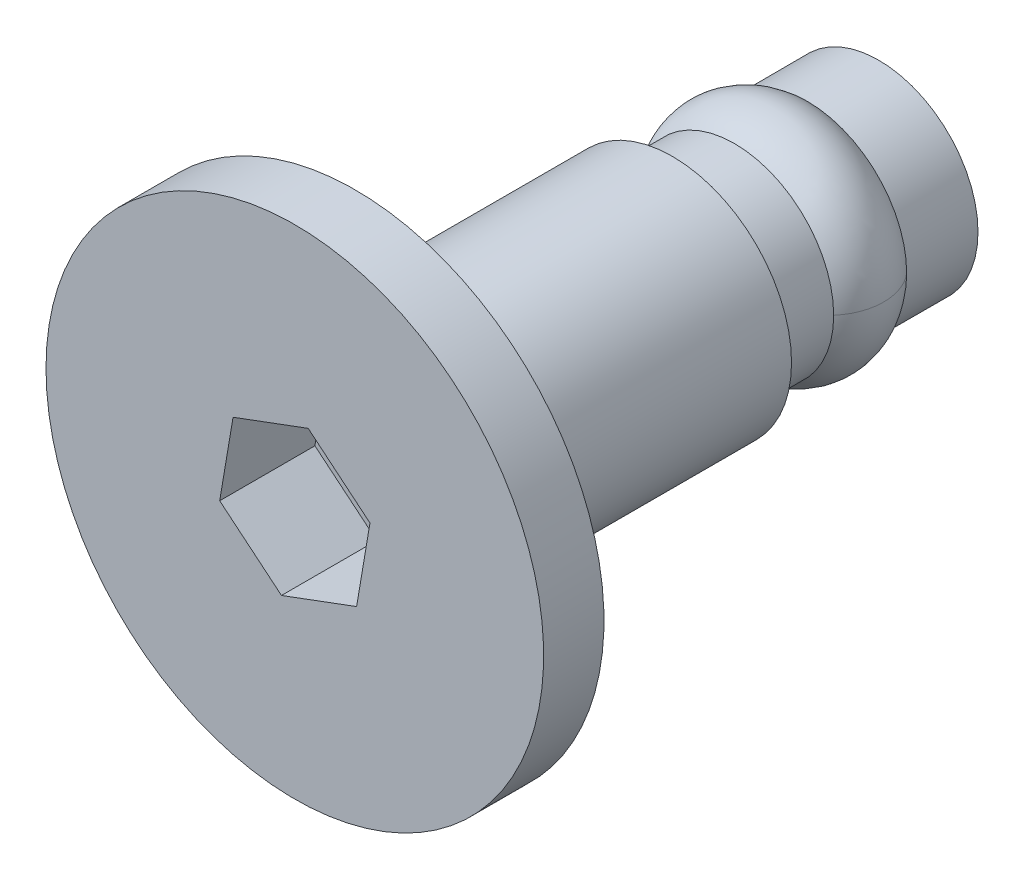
ISO-10303-21;
HEADER;
FILE_DESCRIPTION(('STEP AP214'),'2;1');
FILE_NAME('part.step','',(''),(''),'','','');
FILE_SCHEMA(('AUTOMOTIVE_DESIGN { 1 0 10303 214 1 1 1 1 }'));
ENDSEC;
DATA;
#1=APPLICATION_CONTEXT('core data for automotive mechanical design processes');
#2=APPLICATION_PROTOCOL_DEFINITION('international standard','automotive_design',2000,#1);
#3=PRODUCT_CONTEXT('',#1,'mechanical');
#4=PRODUCT('Part','Part','',(#3));
#5=PRODUCT_RELATED_PRODUCT_CATEGORY('part','',(#4));
#6=PRODUCT_DEFINITION_FORMATION('','',#4);
#7=PRODUCT_DEFINITION_CONTEXT('part definition',#1,'design');
#8=PRODUCT_DEFINITION('design','',#6,#7);
#9=PRODUCT_DEFINITION_SHAPE('','',#8);
#10=(LENGTH_UNIT() NAMED_UNIT(*) SI_UNIT(.MILLI.,.METRE.));
#11=(NAMED_UNIT(*) PLANE_ANGLE_UNIT() SI_UNIT($,.RADIAN.));
#12=(NAMED_UNIT(*) SI_UNIT($,.STERADIAN.) SOLID_ANGLE_UNIT());
#13=UNCERTAINTY_MEASURE_WITH_UNIT(LENGTH_MEASURE(1.E-05),#10,'distance_accuracy_value','');
#14=(GEOMETRIC_REPRESENTATION_CONTEXT(3) GLOBAL_UNCERTAINTY_ASSIGNED_CONTEXT((#13)) GLOBAL_UNIT_ASSIGNED_CONTEXT((#10,
#11,#12)) REPRESENTATION_CONTEXT('',''));
#15=CARTESIAN_POINT('',(0.,0.,0.));
#16=DIRECTION('',(0.,0.,1.));
#17=DIRECTION('',(1.,0.,0.));
#18=AXIS2_PLACEMENT_3D('',#15,#16,#17);
#19=CARTESIAN_POINT('',(1.79027402,-1.79027402,-22.225));
#20=DIRECTION('',(0.,0.,-1.));
#21=DIRECTION('',(-1.,0.,0.));
#22=AXIS2_PLACEMENT_3D('',#19,#20,#21);
#23=PLANE('',#22);
#24=CARTESIAN_POINT('',(0.,0.,-22.2250000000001));
#25=DIRECTION('',(0.,0.,1.));
#26=DIRECTION('',(1.,0.,0.));
#27=AXIS2_PLACEMENT_3D('',#24,#25,#26);
#28=CIRCLE('',#27,1.76904547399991);
#29=CARTESIAN_POINT('',(1.76904547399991,0.,-22.2250000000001));
#30=VERTEX_POINT('',#29);
#31=EDGE_CURVE('E20',#30,#30,#28,.F.);
#32=ORIENTED_EDGE('',*,*,#31,.T.);
#33=EDGE_LOOP('',(#32));
#34=FACE_BOUND('',#33,.T.);
#35=ADVANCED_FACE('F16',(#34),#23,.T.);
#36=CARTESIAN_POINT('',(0.,0.,-22.225));
#37=DIRECTION('',(0.,0.,1.));
#38=DIRECTION('',(1.,0.,0.));
#39=AXIS2_PLACEMENT_3D('',#36,#37,#38);
#40=CONICAL_SURFACE('',#39,1.769045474,1.04719755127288);
#41=CARTESIAN_POINT('',(0.,0.,-20.955));
#42=DIRECTION('',(0.,0.,1.));
#43=DIRECTION('',(1.,0.,0.));
#44=AXIS2_PLACEMENT_3D('',#41,#42,#43);
#45=CIRCLE('',#44,3.96875);
#46=CARTESIAN_POINT('',(3.96875,0.,-20.955));
#47=VERTEX_POINT('',#46);
#48=EDGE_CURVE('E114',#47,#47,#45,.F.);
#49=ORIENTED_EDGE('',*,*,#48,.T.);
#50=EDGE_LOOP('',(#49));
#51=FACE_BOUND('',#50,.T.);
#52=ORIENTED_EDGE('',*,*,#31,.F.);
#53=EDGE_LOOP('',(#52));
#54=FACE_BOUND('',#53,.T.);
#55=ADVANCED_FACE('F235',(#51,#54),#40,.T.);
#56=CARTESIAN_POINT('',(0.,0.,-20.955));
#57=DIRECTION('',(0.,0.,1.));
#58=DIRECTION('',(1.,0.,0.));
#59=AXIS2_PLACEMENT_3D('',#56,#57,#58);
#60=CYLINDRICAL_SURFACE('',#59,3.96875);
#61=CARTESIAN_POINT('',(0.,0.,-18.1009620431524));
#62=DIRECTION('',(0.,0.,1.));
#63=DIRECTION('',(0.,-1.,0.));
#64=AXIS2_PLACEMENT_3D('',#61,#62,#63);
#65=CIRCLE('',#64,3.9687499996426);
#66=CARTESIAN_POINT('',(3.96874999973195,0.,-18.1009620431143));
#67=VERTEX_POINT('',#66);
#68=CARTESIAN_POINT('',(-3.96874999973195,-4.0700211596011E-10,-18.1009620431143));
#69=VERTEX_POINT('',#68);
#70=EDGE_CURVE('E102',#67,#69,#65,.T.);
#71=ORIENTED_EDGE('',*,*,#70,.F.);
#72=CARTESIAN_POINT('',(0.,0.,-18.1009620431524));
#73=DIRECTION('',(0.,0.,1.));
#74=DIRECTION('',(0.,-1.,0.));
#75=AXIS2_PLACEMENT_3D('',#72,#73,#74);
#76=CIRCLE('',#75,3.9687499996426);
#77=EDGE_CURVE('E99',#69,#67,#76,.T.);
#78=ORIENTED_EDGE('',*,*,#77,.F.);
#79=EDGE_LOOP('',(#71,#78));
#80=FACE_BOUND('',#79,.T.);
#81=ORIENTED_EDGE('',*,*,#48,.F.);
#82=EDGE_LOOP('',(#81));
#83=FACE_BOUND('',#82,.T.);
#84=ADVANCED_FACE('F103',(#80,#83),#60,.T.);
#85=CARTESIAN_POINT('',(-3.814448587,0.,-15.017505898));
#86=CARTESIAN_POINT('',(-3.814448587,-7.628897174,-15.017505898));
#87=CARTESIAN_POINT('',(3.814448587,-7.628897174,-15.017505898));
#88=CARTESIAN_POINT('',(3.814448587,0.,-15.017505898));
#89=CARTESIAN_POINT('',(-4.800796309,0.,-15.958877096));
#90=CARTESIAN_POINT('',(-4.800796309,-9.601592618,-15.958877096));
#91=CARTESIAN_POINT('',(4.800796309,-9.601592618,-15.958877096));
#92=CARTESIAN_POINT('',(4.800796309,0.,-15.958877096));
#93=CARTESIAN_POINT('',(-4.800796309,0.,-17.322351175));
#94=CARTESIAN_POINT('',(-4.800796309,-9.601592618,-17.322351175));
#95=CARTESIAN_POINT('',(4.800796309,-9.601592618,-17.322351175));
#96=CARTESIAN_POINT('',(4.800796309,0.,-17.322351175));
#97=CARTESIAN_POINT('',(-3.814448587,0.,-18.263722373));
#98=CARTESIAN_POINT('',(-3.814448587,-7.628897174,-18.263722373));
#99=CARTESIAN_POINT('',(3.814448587,-7.628897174,-18.263722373));
#100=CARTESIAN_POINT('',(3.814448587,0.,-18.263722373));
#101=(BOUNDED_SURFACE() B_SPLINE_SURFACE(3,3,((#85,#86,#87,#88),(#89,#90,#91,#92),(#93,#94,#95,
#96),(#97,#98,#99,#100)),.UNSPECIFIED.,.F.,.F.,.F.) B_SPLINE_SURFACE_WITH_KNOTS((4,4),(4,4),(0.,
1.),(0.,1.),.UNSPECIFIED.) GEOMETRIC_REPRESENTATION_ITEM() RATIONAL_B_SPLINE_SURFACE(((1.,
0.333333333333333,0.333333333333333,1.),(0.793614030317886,0.264538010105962,0.264538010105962,
0.793614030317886),(0.793614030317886,0.264538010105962,0.264538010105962,0.793614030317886),
(1.,0.333333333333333,0.333333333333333,1.))) REPRESENTATION_ITEM('') SURFACE());
#102=CARTESIAN_POINT('',(3.814448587,0.,-15.017505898));
#103=CARTESIAN_POINT('',(4.800796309,0.,-15.958877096));
#104=CARTESIAN_POINT('',(4.800796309,0.,-17.322351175));
#105=CARTESIAN_POINT('',(3.814448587,0.,-18.263722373));
#106=(BOUNDED_CURVE() B_SPLINE_CURVE(3,(#102,#103,#104,#105),.UNSPECIFIED.,.F.,
.F.) B_SPLINE_CURVE_WITH_KNOTS((4,4),(0.,1.),
.UNSPECIFIED.) CURVE() GEOMETRIC_REPRESENTATION_ITEM() RATIONAL_B_SPLINE_CURVE((1.,
0.793614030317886,0.793614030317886,1.)) REPRESENTATION_ITEM(''));
#107=CARTESIAN_POINT('',(3.96874999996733,-1.78184231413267E-10,-15.180266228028));
#108=VERTEX_POINT('',#107);
#109=EDGE_CURVE('E112',#108,#67,#106,.T.);
#110=CARTESIAN_POINT('',(0.,0.,-15.180266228));
#111=DIRECTION('',(0.,0.,1.));
#112=DIRECTION('',(1.,0.,0.));
#113=AXIS2_PLACEMENT_3D('',#110,#111,#112);
#114=CIRCLE('',#113,3.96875);
#115=CARTESIAN_POINT('',(-3.96874999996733,-1.22100634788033E-09,-15.180266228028));
#116=VERTEX_POINT('',#115);
#117=EDGE_CURVE('E120',#108,#116,#114,.F.);
#118=CARTESIAN_POINT('',(-3.814448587,0.,-15.017505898));
#119=CARTESIAN_POINT('',(-4.800796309,0.,-15.958877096));
#120=CARTESIAN_POINT('',(-4.800796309,0.,-17.322351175));
#121=CARTESIAN_POINT('',(-3.814448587,0.,-18.263722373));
#122=(BOUNDED_CURVE() B_SPLINE_CURVE(3,(#118,#119,#120,#121),.UNSPECIFIED.,.F.,
.F.) B_SPLINE_CURVE_WITH_KNOTS((4,4),(0.,1.),
.UNSPECIFIED.) CURVE() GEOMETRIC_REPRESENTATION_ITEM() RATIONAL_B_SPLINE_CURVE((1.,
0.793614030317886,0.793614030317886,1.)) REPRESENTATION_ITEM(''));
#123=EDGE_CURVE('E108',#69,#116,#122,.F.);
#124=ORIENTED_EDGE('',*,*,#109,.F.);
#125=ORIENTED_EDGE('',*,*,#117,.T.);
#126=ORIENTED_EDGE('',*,*,#123,.F.);
#127=ORIENTED_EDGE('',*,*,#77,.T.);
#128=EDGE_LOOP('',(#124,#125,#126,#127));
#129=FACE_BOUND('',#128,.T.);
#130=ADVANCED_FACE('F111',(#129),#101,.T.);
#131=CARTESIAN_POINT('',(3.814448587,0.,-15.017505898));
#132=CARTESIAN_POINT('',(3.814448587,7.628897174,-15.017505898));
#133=CARTESIAN_POINT('',(-3.814448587,7.628897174,-15.017505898));
#134=CARTESIAN_POINT('',(-3.814448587,0.,-15.017505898));
#135=CARTESIAN_POINT('',(4.800796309,0.,-15.958877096));
#136=CARTESIAN_POINT('',(4.800796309,9.601592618,-15.958877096));
#137=CARTESIAN_POINT('',(-4.800796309,9.601592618,-15.958877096));
#138=CARTESIAN_POINT('',(-4.800796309,0.,-15.958877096));
#139=CARTESIAN_POINT('',(4.800796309,0.,-17.322351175));
#140=CARTESIAN_POINT('',(4.800796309,9.601592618,-17.322351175));
#141=CARTESIAN_POINT('',(-4.800796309,9.601592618,-17.322351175));
#142=CARTESIAN_POINT('',(-4.800796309,0.,-17.322351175));
#143=CARTESIAN_POINT('',(3.814448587,0.,-18.263722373));
#144=CARTESIAN_POINT('',(3.814448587,7.628897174,-18.263722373));
#145=CARTESIAN_POINT('',(-3.814448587,7.628897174,-18.263722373));
#146=CARTESIAN_POINT('',(-3.814448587,0.,-18.263722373));
#147=(BOUNDED_SURFACE() B_SPLINE_SURFACE(3,3,((#131,#132,#133,#134),(#135,#136,#137,#138),(#139,
#140,#141,#142),(#143,#144,#145,#146)),.UNSPECIFIED.,.F.,.F.,
.F.) B_SPLINE_SURFACE_WITH_KNOTS((4,4),(4,4),(0.,1.),(0.,1.),
.UNSPECIFIED.) GEOMETRIC_REPRESENTATION_ITEM() RATIONAL_B_SPLINE_SURFACE(((1.,0.333333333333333,
0.333333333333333,1.),(0.793614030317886,0.264538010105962,0.264538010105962,0.793614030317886),
(0.793614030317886,0.264538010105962,0.264538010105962,0.793614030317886),(1.,0.333333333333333,
0.333333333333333,1.))) REPRESENTATION_ITEM('') SURFACE());
#148=CARTESIAN_POINT('',(0.,0.,-15.180266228));
#149=DIRECTION('',(0.,0.,1.));
#150=DIRECTION('',(1.,0.,0.));
#151=AXIS2_PLACEMENT_3D('',#148,#149,#150);
#152=CIRCLE('',#151,3.96875);
#153=EDGE_CURVE('E119',#116,#108,#152,.F.);
#154=ORIENTED_EDGE('',*,*,#153,.T.);
#155=ORIENTED_EDGE('',*,*,#109,.T.);
#156=ORIENTED_EDGE('',*,*,#70,.T.);
#157=ORIENTED_EDGE('',*,*,#123,.T.);
#158=EDGE_LOOP('',(#154,#155,#156,#157));
#159=FACE_BOUND('',#158,.T.);
#160=ADVANCED_FACE('F117',(#159),#147,.T.);
#161=CARTESIAN_POINT('',(0.,0.,-15.180266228));
#162=DIRECTION('',(0.,0.,1.));
#163=DIRECTION('',(1.,0.,0.));
#164=AXIS2_PLACEMENT_3D('',#161,#162,#163);
#165=CYLINDRICAL_SURFACE('',#164,3.96875);
#166=CARTESIAN_POINT('',(0.,0.,-12.7));
#167=DIRECTION('',(0.,0.,1.));
#168=DIRECTION('',(1.,0.,0.));
#169=AXIS2_PLACEMENT_3D('',#166,#167,#168);
#170=CIRCLE('',#169,3.96875);
#171=CARTESIAN_POINT('',(3.96875,0.,-12.7));
#172=VERTEX_POINT('',#171);
#173=EDGE_CURVE('E342',#172,#172,#170,.T.);
#174=ORIENTED_EDGE('',*,*,#173,.F.);
#175=EDGE_LOOP('',(#174));
#176=FACE_BOUND('',#175,.T.);
#177=ORIENTED_EDGE('',*,*,#153,.F.);
#178=ORIENTED_EDGE('',*,*,#117,.F.);
#179=EDGE_LOOP('',(#177,#178));
#180=FACE_BOUND('',#179,.T.);
#181=ADVANCED_FACE('F231',(#176,#180),#165,.T.);
#182=CARTESIAN_POINT('',(4.81965,-4.81965,-12.7));
#183=DIRECTION('',(0.,0.,-1.));
#184=DIRECTION('',(-1.,0.,0.));
#185=AXIS2_PLACEMENT_3D('',#182,#183,#184);
#186=PLANE('',#185);
#187=ORIENTED_EDGE('',*,*,#173,.T.);
#188=EDGE_LOOP('',(#187));
#189=FACE_BOUND('',#188,.T.);
#190=CARTESIAN_POINT('',(0.,0.,-12.7));
#191=DIRECTION('',(0.,0.,1.));
#192=DIRECTION('',(1.,0.,0.));
#193=AXIS2_PLACEMENT_3D('',#190,#191,#192);
#194=CIRCLE('',#193,4.7625);
#195=CARTESIAN_POINT('',(4.7625,0.,-12.7));
#196=VERTEX_POINT('',#195);
#197=EDGE_CURVE('E327',#196,#196,#194,.F.);
#198=ORIENTED_EDGE('',*,*,#197,.T.);
#199=EDGE_LOOP('',(#198));
#200=FACE_BOUND('',#199,.T.);
#201=ADVANCED_FACE('F228',(#189,#200),#186,.T.);
#202=CARTESIAN_POINT('',(0.,0.,-12.7));
#203=DIRECTION('',(0.,0.,1.));
#204=DIRECTION('',(1.,0.,0.));
#205=AXIS2_PLACEMENT_3D('',#202,#203,#204);
#206=CYLINDRICAL_SURFACE('',#205,4.7625);
#207=ORIENTED_EDGE('',*,*,#197,.F.);
#208=EDGE_LOOP('',(#207));
#209=FACE_BOUND('',#208,.T.);
#210=CARTESIAN_POINT('',(0.,0.,-2.67515113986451));
#211=DIRECTION('',(0.,0.,1.));
#212=DIRECTION('',(1.,0.,0.));
#213=AXIS2_PLACEMENT_3D('',#210,#211,#212);
#214=CIRCLE('',#213,4.76249999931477);
#215=CARTESIAN_POINT('',(4.76249999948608,-2.13821077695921E-10,-2.67515113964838));
#216=VERTEX_POINT('',#215);
#217=CARTESIAN_POINT('',(-4.76249999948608,-4.88402539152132E-10,-2.67515113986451));
#218=VERTEX_POINT('',#217);
#219=EDGE_CURVE('E318',#216,#218,#214,.T.);
#220=ORIENTED_EDGE('',*,*,#219,.F.);
#221=CARTESIAN_POINT('',(0.,0.,-2.67515113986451));
#222=DIRECTION('',(0.,0.,1.));
#223=DIRECTION('',(1.,0.,0.));
#224=AXIS2_PLACEMENT_3D('',#221,#222,#223);
#225=CIRCLE('',#224,4.76249999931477);
#226=EDGE_CURVE('E309',#218,#216,#225,.T.);
#227=ORIENTED_EDGE('',*,*,#226,.F.);
#228=EDGE_LOOP('',(#220,#227));
#229=FACE_BOUND('',#228,.T.);
#230=ADVANCED_FACE('F227',(#209,#229),#206,.T.);
#231=CARTESIAN_POINT('',(3.006573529,-3.16304395,-1.397));
#232=DIRECTION('',(0.,0.,-1.));
#233=DIRECTION('',(-1.,0.,0.));
#234=AXIS2_PLACEMENT_3D('',#231,#232,#233);
#235=PLANE('',#234);
#236=DIRECTION('',(0.166649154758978,0.986016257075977,0.));
#237=VECTOR('',#236,1.);
#238=CARTESIAN_POINT('',(2.7392764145,-0.462972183,-1.397));
#239=LINE('',#238,#237);
#240=CARTESIAN_POINT('',(2.47197930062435,-2.04449415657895,-1.397));
#241=VERTEX_POINT('',#240);
#242=CARTESIAN_POINT('',(3.00657352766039,1.11854979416,-1.397));
#243=VERTEX_POINT('',#242);
#244=EDGE_CURVE('E70',#241,#243,#239,.T.);
#245=ORIENTED_EDGE('',*,*,#244,.T.);
#246=DIRECTION('',(-0.770590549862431,0.637330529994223,0.));
#247=VECTOR('',#246,1.);
#248=CARTESIAN_POINT('',(1.770583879,2.140796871,-1.397));
#249=LINE('',#248,#247);
#250=CARTESIAN_POINT('',(0.534594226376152,3.16304394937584,-1.397));
#251=VERTEX_POINT('',#250);
#252=EDGE_CURVE('E144',#243,#251,#249,.T.);
#253=ORIENTED_EDGE('',*,*,#252,.T.);
#254=DIRECTION('',(-0.937239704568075,-0.348685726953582,0.));
#255=VECTOR('',#254,1.);
#256=CARTESIAN_POINT('',(-0.9686925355,2.603769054,-1.397));
#257=LINE('',#256,#255);
#258=CARTESIAN_POINT('',(-2.47197930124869,2.0444941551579,-1.397));
#259=VERTEX_POINT('',#258);
#260=EDGE_CURVE('E155',#251,#259,#257,.T.);
#261=ORIENTED_EDGE('',*,*,#260,.T.);
#262=DIRECTION('',(-0.166649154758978,-0.986016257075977,0.));
#263=VECTOR('',#262,1.);
#264=CARTESIAN_POINT('',(-2.7392764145,0.462972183,-1.397));
#265=LINE('',#264,#263);
#266=CARTESIAN_POINT('',(-3.00657352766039,-1.11854979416,-1.397));
#267=VERTEX_POINT('',#266);
#268=EDGE_CURVE('E151',#259,#267,#265,.T.);
#269=ORIENTED_EDGE('',*,*,#268,.T.);
#270=DIRECTION('',(0.770590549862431,-0.637330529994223,0.));
#271=VECTOR('',#270,1.);
#272=CARTESIAN_POINT('',(-1.770583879,-2.140796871,-1.397));
#273=LINE('',#272,#271);
#274=CARTESIAN_POINT('',(-0.53459422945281,-3.16304394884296,-1.397));
#275=VERTEX_POINT('',#274);
#276=EDGE_CURVE('E152',#267,#275,#273,.T.);
#277=ORIENTED_EDGE('',*,*,#276,.T.);
#278=DIRECTION('',(0.937239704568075,0.348685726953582,0.));
#279=VECTOR('',#278,1.);
#280=CARTESIAN_POINT('',(0.9686925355,-2.603769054,-1.397));
#281=LINE('',#280,#279);
#282=EDGE_CURVE('E304',#275,#241,#281,.T.);
#283=ORIENTED_EDGE('',*,*,#282,.T.);
#284=EDGE_LOOP('',(#245,#253,#261,#269,#277,#283));
#285=FACE_BOUND('',#284,.T.);
#286=ADVANCED_FACE('F223',(#285),#235,.F.);
#287=CARTESIAN_POINT('',(4.619568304,0.,0.181100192));
#288=CARTESIAN_POINT('',(4.619568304,9.239136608,0.181100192));
#289=CARTESIAN_POINT('',(-4.619568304,9.239136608,0.181100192));
#290=CARTESIAN_POINT('',(-4.619568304,0.,0.181100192));
#291=CARTESIAN_POINT('',(5.417055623,0.,-0.731572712));
#292=CARTESIAN_POINT('',(5.417055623,10.834111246,-0.731572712));
#293=CARTESIAN_POINT('',(-5.417055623,10.834111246,-0.731572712));
#294=CARTESIAN_POINT('',(-5.417055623,0.,-0.731572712));
#295=CARTESIAN_POINT('',(5.417055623,0.,-1.943578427));
#296=CARTESIAN_POINT('',(5.417055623,10.834111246,-1.943578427));
#297=CARTESIAN_POINT('',(-5.417055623,10.834111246,-1.943578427));
#298=CARTESIAN_POINT('',(-5.417055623,0.,-1.943578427));
#299=CARTESIAN_POINT('',(4.619568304,0.,-2.856251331));
#300=CARTESIAN_POINT('',(4.619568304,9.239136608,-2.856251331));
#301=CARTESIAN_POINT('',(-4.619568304,9.239136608,-2.856251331));
#302=CARTESIAN_POINT('',(-4.619568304,0.,-2.856251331));
#303=(BOUNDED_SURFACE() B_SPLINE_SURFACE(3,3,((#287,#288,#289,#290),(#291,#292,#293,#294),(#295,
#296,#297,#298),(#299,#300,#301,#302)),.UNSPECIFIED.,.F.,.F.,
.F.) B_SPLINE_SURFACE_WITH_KNOTS((4,4),(4,4),(0.,1.),(0.,1.),
.UNSPECIFIED.) GEOMETRIC_REPRESENTATION_ITEM() RATIONAL_B_SPLINE_SURFACE(((1.,0.333333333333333,
0.333333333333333,1.),(0.835351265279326,0.278450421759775,0.278450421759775,0.835351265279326),
(0.835351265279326,0.278450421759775,0.278450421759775,0.835351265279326),(1.,0.333333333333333,
0.333333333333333,1.))) REPRESENTATION_ITEM('') SURFACE());
#304=CARTESIAN_POINT('',(-4.76249999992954,0.,0.));
#305=CARTESIAN_POINT('',(-4.76251440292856,0.13394681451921,0.));
#306=CARTESIAN_POINT('',(-4.75684966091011,0.267891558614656,0.));
#307=CARTESIAN_POINT('',(-4.73426590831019,0.53482276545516,0.));
#308=CARTESIAN_POINT('',(-4.717347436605,0.66780927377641,0.));
#309=CARTESIAN_POINT('',(-4.67237603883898,0.931790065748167,0.));
#310=CARTESIAN_POINT('',(-4.64433094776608,1.06278568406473,0.));
#311=CARTESIAN_POINT('',(-4.57731034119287,1.32194846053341,0.));
#312=CARTESIAN_POINT('',(-4.53833495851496,1.45011565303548,0.));
#313=CARTESIAN_POINT('',(-4.44971660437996,1.70274877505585,0.));
#314=CARTESIAN_POINT('',(-4.40007058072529,1.82721363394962,0.));
#315=CARTESIAN_POINT('',(-4.29045046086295,2.07156425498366,0.));
#316=CARTESIAN_POINT('',(-4.23047255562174,2.19144830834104,0.));
#317=CARTESIAN_POINT('',(-4.10066468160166,2.42566955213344,0.));
#318=CARTESIAN_POINT('',(-4.03084030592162,2.54000984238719,0.));
#319=CARTESIAN_POINT('',(-3.88178249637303,2.76244481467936,0.));
#320=CARTESIAN_POINT('',(-3.80254559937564,2.87053717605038,0.));
#321=CARTESIAN_POINT('',(-3.63527586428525,3.0796255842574,0.));
#322=CARTESIAN_POINT('',(-3.54724608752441,3.18062408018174,0.));
#323=CARTESIAN_POINT('',(-3.36295908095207,3.37488425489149,0.));
#324=CARTESIAN_POINT('',(-3.2666988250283,3.46814306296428,0.));
#325=CARTESIAN_POINT('',(-3.06668509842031,3.64619970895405,0.));
#326=CARTESIAN_POINT('',(-2.96293325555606,3.73099937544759,0.));
#327=CARTESIAN_POINT('',(-2.74861571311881,3.89158767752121,0.));
#328=CARTESIAN_POINT('',(-2.63804751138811,3.96737297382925,0.));
#329=CARTESIAN_POINT('',(-2.41096537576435,4.10932770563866,0.));
#330=CARTESIAN_POINT('',(-2.29445391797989,4.17550110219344,0.));
#331=CARTESIAN_POINT('',(-2.05622724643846,4.29782164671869,0.));
#332=CARTESIAN_POINT('',(-1.93451012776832,4.35396508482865,0.));
#333=CARTESIAN_POINT('',(-1.68683173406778,4.45577430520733,0.));
#334=CARTESIAN_POINT('',(-1.56087231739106,4.5014446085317,0.));
#335=CARTESIAN_POINT('',(-1.30550743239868,4.58202896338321,0.));
#336=CARTESIAN_POINT('',(-1.17610071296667,4.61693905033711,0.));
#337=CARTESIAN_POINT('',(-0.91485020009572,4.67572199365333,0.));
#338=CARTESIAN_POINT('',(-0.783007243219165,4.69959856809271,0.));
#339=CARTESIAN_POINT('',(-0.517732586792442,4.73616853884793,0.));
#340=CARTESIAN_POINT('',(-0.384300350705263,4.74885804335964,0.));
#341=CARTESIAN_POINT('',(-0.116861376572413,4.76294840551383,0.));
#342=CARTESIAN_POINT('',(0.0171452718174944,4.76435096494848,0.));
#343=CARTESIAN_POINT('',(0.284800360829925,4.75586194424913,0.));
#344=CARTESIAN_POINT('',(0.418448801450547,4.74597036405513,0.));
#345=CARTESIAN_POINT('',(0.684459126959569,4.71496083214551,0.));
#346=CARTESIAN_POINT('',(0.816820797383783,4.69384104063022,0.));
#347=CARTESIAN_POINT('',(1.07924828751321,4.64053344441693,0.));
#348=CARTESIAN_POINT('',(1.20931488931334,4.60834948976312,0.));
#349=CARTESIAN_POINT('',(1.46632076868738,4.53312735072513,0.));
#350=CARTESIAN_POINT('',(1.59325892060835,4.49008532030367,0.));
#351=CARTESIAN_POINT('',(1.84301118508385,4.39347662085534,0.));
#352=CARTESIAN_POINT('',(1.96582679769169,4.33991382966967,0.));
#353=CARTESIAN_POINT('',(2.20655779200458,4.22261102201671,0.));
#354=CARTESIAN_POINT('',(2.32447121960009,4.15886699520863,0.));
#355=CARTESIAN_POINT('',(2.55446517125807,4.02169561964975,0.));
#356=CARTESIAN_POINT('',(2.66654783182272,3.94827185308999,0.));
#357=CARTESIAN_POINT('',(2.8841653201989,3.79221963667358,0.));
#358=CARTESIAN_POINT('',(2.98969804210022,3.70958825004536,0.));
#359=CARTESIAN_POINT('',(3.19338840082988,3.53575970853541,0.));
#360=CARTESIAN_POINT('',(3.29154874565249,3.4445657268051,0.));
#361=CARTESIAN_POINT('',(3.47986199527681,3.25421189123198,0.));
#362=CARTESIAN_POINT('',(3.57001301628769,3.15505017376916,0.));
#363=CARTESIAN_POINT('',(3.74160904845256,2.94952252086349,0.));
#364=CARTESIAN_POINT('',(3.82305725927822,2.84315925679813,0.));
#365=CARTESIAN_POINT('',(3.97676004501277,2.62387604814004,0.));
#366=CARTESIAN_POINT('',(4.04900825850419,2.51095164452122,0.));
#367=CARTESIAN_POINT('',(4.18370649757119,2.27945885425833,0.));
#368=CARTESIAN_POINT('',(4.24616013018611,2.16089256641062,0.));
#369=CARTESIAN_POINT('',(4.36091371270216,1.91880164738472,0.));
#370=CARTESIAN_POINT('',(4.41320363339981,1.79527226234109,0.));
#371=CARTESIAN_POINT('',(4.50716325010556,1.54429053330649,0.));
#372=CARTESIAN_POINT('',(4.54883693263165,1.41683968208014,0.));
#373=CARTESIAN_POINT('',(4.62125295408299,1.15902453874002,0.));
#374=CARTESIAN_POINT('',(4.65200728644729,1.02866361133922,0.));
#375=CARTESIAN_POINT('',(4.70241869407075,0.765866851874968,0.));
#376=CARTESIAN_POINT('',(4.72208121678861,0.63343207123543,0.));
#377=CARTESIAN_POINT('',(4.74492371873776,0.417257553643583,0.));
#378=CARTESIAN_POINT('',(4.75151902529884,0.333863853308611,0.));
#379=CARTESIAN_POINT('',(4.76030400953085,0.166982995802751,0.));
#380=CARTESIAN_POINT('',(4.7625009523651,0.0834962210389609,0.));
#381=CARTESIAN_POINT('',(4.76249999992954,0.,0.));
#382=B_SPLINE_CURVE_WITH_KNOTS('',3,(#304,#305,#306,#307,#308,#309,#310,#311,#312,#313,#314,
#315,#316,#317,#318,#319,#320,#321,#322,#323,#324,#325,#326,#327,#328,#329,#330,#331,#332,#333,
#334,#335,#336,#337,#338,#339,#340,#341,#342,#343,#344,#345,#346,#347,#348,#349,#350,#351,#352,
#353,#354,#355,#356,#357,#358,#359,#360,#361,#362,#363,#364,#365,#366,#367,#368,#369,#370,#371,
#372,#373,#374,#375,#376,#377,#378,#379,#380,#381),.UNSPECIFIED.,.F.,.F.,(4,2,2,2,2,2,2,2,2,2,2,
2,2,2,2,2,2,2,2,2,2,2,2,2,2,2,2,2,2,2,2,2,2,2,2,2,2,2,4),(0.,0.401717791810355,
0.803416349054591,1.20483254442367,1.6062438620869,2.00777015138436,2.40944478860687,
2.81089217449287,3.21248772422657,3.61394393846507,4.01554839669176,4.41706585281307,
4.81873158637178,5.22023132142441,5.621879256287,6.02335347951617,6.42497544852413,
6.82646197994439,7.22808812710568,7.62965371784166,8.03121931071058,8.43285072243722,
8.83434251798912,9.2359767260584,9.63746317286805,10.0391081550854,10.4406049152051,
10.8422301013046,11.2437070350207,11.645278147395,12.0467011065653,12.4484001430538,
12.849950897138,13.251895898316,13.6536897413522,14.0550408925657,14.4561947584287,
14.7070504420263,14.9574914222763),.UNSPECIFIED.);
#383=CARTESIAN_POINT('',(-4.76249999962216,0.,4.3225330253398E-10));
#384=VERTEX_POINT('',#383);
#385=CARTESIAN_POINT('',(4.76249999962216,0.,4.3225330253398E-10));
#386=VERTEX_POINT('',#385);
#387=EDGE_CURVE('E146',#384,#386,#382,.T.);
#388=CARTESIAN_POINT('',(4.619568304,0.,0.181100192));
#389=CARTESIAN_POINT('',(5.417055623,0.,-0.731572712));
#390=CARTESIAN_POINT('',(5.417055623,0.,-1.943578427));
#391=CARTESIAN_POINT('',(4.619568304,0.,-2.856251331));
#392=(BOUNDED_CURVE() B_SPLINE_CURVE(3,(#388,#389,#390,#391),.UNSPECIFIED.,.F.,
.F.) B_SPLINE_CURVE_WITH_KNOTS((4,4),(0.,1.),
.UNSPECIFIED.) CURVE() GEOMETRIC_REPRESENTATION_ITEM() RATIONAL_B_SPLINE_CURVE((1.,
0.835351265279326,0.835351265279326,1.)) REPRESENTATION_ITEM(''));
#393=EDGE_CURVE('E306',#216,#386,#392,.F.);
#394=CARTESIAN_POINT('',(-4.619568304,0.,0.181100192));
#395=CARTESIAN_POINT('',(-5.417055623,0.,-0.731572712));
#396=CARTESIAN_POINT('',(-5.417055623,0.,-1.943578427));
#397=CARTESIAN_POINT('',(-4.619568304,0.,-2.856251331));
#398=(BOUNDED_CURVE() B_SPLINE_CURVE(3,(#394,#395,#396,#397),.UNSPECIFIED.,.F.,
.F.) B_SPLINE_CURVE_WITH_KNOTS((4,4),(0.,1.),
.UNSPECIFIED.) CURVE() GEOMETRIC_REPRESENTATION_ITEM() RATIONAL_B_SPLINE_CURVE((1.,
0.835351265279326,0.835351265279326,1.)) REPRESENTATION_ITEM(''));
#399=EDGE_CURVE('E61',#384,#218,#398,.T.);
#400=ORIENTED_EDGE('',*,*,#387,.T.);
#401=ORIENTED_EDGE('',*,*,#393,.F.);
#402=ORIENTED_EDGE('',*,*,#219,.T.);
#403=ORIENTED_EDGE('',*,*,#399,.F.);
#404=EDGE_LOOP('',(#400,#401,#402,#403));
#405=FACE_BOUND('',#404,.T.);
#406=ADVANCED_FACE('F226',(#405),#303,.T.);
#407=CARTESIAN_POINT('',(-4.619568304,0.,0.181100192));
#408=CARTESIAN_POINT('',(-4.619568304,-9.239136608,0.181100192));
#409=CARTESIAN_POINT('',(4.619568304,-9.239136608,0.181100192));
#410=CARTESIAN_POINT('',(4.619568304,0.,0.181100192));
#411=CARTESIAN_POINT('',(-5.417055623,0.,-0.731572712));
#412=CARTESIAN_POINT('',(-5.417055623,-10.834111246,-0.731572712));
#413=CARTESIAN_POINT('',(5.417055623,-10.834111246,-0.731572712));
#414=CARTESIAN_POINT('',(5.417055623,0.,-0.731572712));
#415=CARTESIAN_POINT('',(-5.417055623,0.,-1.943578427));
#416=CARTESIAN_POINT('',(-5.417055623,-10.834111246,-1.943578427));
#417=CARTESIAN_POINT('',(5.417055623,-10.834111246,-1.943578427));
#418=CARTESIAN_POINT('',(5.417055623,0.,-1.943578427));
#419=CARTESIAN_POINT('',(-4.619568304,0.,-2.856251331));
#420=CARTESIAN_POINT('',(-4.619568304,-9.239136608,-2.856251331));
#421=CARTESIAN_POINT('',(4.619568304,-9.239136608,-2.856251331));
#422=CARTESIAN_POINT('',(4.619568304,0.,-2.856251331));
#423=(BOUNDED_SURFACE() B_SPLINE_SURFACE(3,3,((#407,#408,#409,#410),(#411,#412,#413,#414),(#415,
#416,#417,#418),(#419,#420,#421,#422)),.UNSPECIFIED.,.F.,.F.,
.F.) B_SPLINE_SURFACE_WITH_KNOTS((4,4),(4,4),(0.,1.),(0.,1.),
.UNSPECIFIED.) GEOMETRIC_REPRESENTATION_ITEM() RATIONAL_B_SPLINE_SURFACE(((1.,0.333333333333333,
0.333333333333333,1.),(0.835351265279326,0.278450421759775,0.278450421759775,0.835351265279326),
(0.835351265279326,0.278450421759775,0.278450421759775,0.835351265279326),(1.,0.333333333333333,
0.333333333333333,1.))) REPRESENTATION_ITEM('') SURFACE());
#424=CARTESIAN_POINT('',(4.76249999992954,0.,0.));
#425=CARTESIAN_POINT('',(4.76251440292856,-0.13394681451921,0.));
#426=CARTESIAN_POINT('',(4.75684966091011,-0.267891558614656,0.));
#427=CARTESIAN_POINT('',(4.73426590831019,-0.53482276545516,0.));
#428=CARTESIAN_POINT('',(4.717347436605,-0.66780927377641,0.));
#429=CARTESIAN_POINT('',(4.67237603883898,-0.931790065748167,0.));
#430=CARTESIAN_POINT('',(4.64433094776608,-1.06278568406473,0.));
#431=CARTESIAN_POINT('',(4.57731034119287,-1.32194846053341,0.));
#432=CARTESIAN_POINT('',(4.53833495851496,-1.45011565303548,0.));
#433=CARTESIAN_POINT('',(4.44971660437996,-1.70274877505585,0.));
#434=CARTESIAN_POINT('',(4.40007058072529,-1.82721363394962,0.));
#435=CARTESIAN_POINT('',(4.29045046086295,-2.07156425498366,0.));
#436=CARTESIAN_POINT('',(4.23047255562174,-2.19144830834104,0.));
#437=CARTESIAN_POINT('',(4.10066468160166,-2.42566955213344,0.));
#438=CARTESIAN_POINT('',(4.03084030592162,-2.54000984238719,0.));
#439=CARTESIAN_POINT('',(3.88178249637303,-2.76244481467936,0.));
#440=CARTESIAN_POINT('',(3.80254559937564,-2.87053717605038,0.));
#441=CARTESIAN_POINT('',(3.63527586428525,-3.0796255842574,0.));
#442=CARTESIAN_POINT('',(3.54724608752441,-3.18062408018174,0.));
#443=CARTESIAN_POINT('',(3.36295908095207,-3.37488425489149,0.));
#444=CARTESIAN_POINT('',(3.2666988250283,-3.46814306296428,0.));
#445=CARTESIAN_POINT('',(3.06668509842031,-3.64619970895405,0.));
#446=CARTESIAN_POINT('',(2.96293325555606,-3.73099937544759,0.));
#447=CARTESIAN_POINT('',(2.74861571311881,-3.89158767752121,0.));
#448=CARTESIAN_POINT('',(2.63804751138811,-3.96737297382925,0.));
#449=CARTESIAN_POINT('',(2.41096537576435,-4.10932770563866,0.));
#450=CARTESIAN_POINT('',(2.29445391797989,-4.17550110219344,0.));
#451=CARTESIAN_POINT('',(2.05622724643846,-4.29782164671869,0.));
#452=CARTESIAN_POINT('',(1.93451012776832,-4.35396508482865,0.));
#453=CARTESIAN_POINT('',(1.68683173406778,-4.45577430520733,0.));
#454=CARTESIAN_POINT('',(1.56087231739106,-4.5014446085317,0.));
#455=CARTESIAN_POINT('',(1.30550743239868,-4.58202896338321,0.));
#456=CARTESIAN_POINT('',(1.17610071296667,-4.61693905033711,0.));
#457=CARTESIAN_POINT('',(0.91485020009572,-4.67572199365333,0.));
#458=CARTESIAN_POINT('',(0.783007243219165,-4.69959856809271,0.));
#459=CARTESIAN_POINT('',(0.517732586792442,-4.73616853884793,0.));
#460=CARTESIAN_POINT('',(0.384300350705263,-4.74885804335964,0.));
#461=CARTESIAN_POINT('',(0.116861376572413,-4.76294840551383,0.));
#462=CARTESIAN_POINT('',(-0.0171452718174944,-4.76435096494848,0.));
#463=CARTESIAN_POINT('',(-0.284800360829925,-4.75586194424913,0.));
#464=CARTESIAN_POINT('',(-0.418448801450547,-4.74597036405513,0.));
#465=CARTESIAN_POINT('',(-0.684459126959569,-4.71496083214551,0.));
#466=CARTESIAN_POINT('',(-0.816820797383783,-4.69384104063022,0.));
#467=CARTESIAN_POINT('',(-1.07924828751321,-4.64053344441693,0.));
#468=CARTESIAN_POINT('',(-1.20931488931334,-4.60834948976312,0.));
#469=CARTESIAN_POINT('',(-1.46632076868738,-4.53312735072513,0.));
#470=CARTESIAN_POINT('',(-1.59325892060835,-4.49008532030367,0.));
#471=CARTESIAN_POINT('',(-1.84301118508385,-4.39347662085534,0.));
#472=CARTESIAN_POINT('',(-1.96582679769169,-4.33991382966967,0.));
#473=CARTESIAN_POINT('',(-2.20655779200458,-4.22261102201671,0.));
#474=CARTESIAN_POINT('',(-2.32447121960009,-4.15886699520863,0.));
#475=CARTESIAN_POINT('',(-2.55446517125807,-4.02169561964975,0.));
#476=CARTESIAN_POINT('',(-2.66654783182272,-3.94827185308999,0.));
#477=CARTESIAN_POINT('',(-2.8841653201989,-3.79221963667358,0.));
#478=CARTESIAN_POINT('',(-2.98969804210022,-3.70958825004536,0.));
#479=CARTESIAN_POINT('',(-3.19338840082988,-3.53575970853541,0.));
#480=CARTESIAN_POINT('',(-3.29154874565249,-3.4445657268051,0.));
#481=CARTESIAN_POINT('',(-3.47986199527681,-3.25421189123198,0.));
#482=CARTESIAN_POINT('',(-3.57001301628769,-3.15505017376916,0.));
#483=CARTESIAN_POINT('',(-3.74160904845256,-2.94952252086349,0.));
#484=CARTESIAN_POINT('',(-3.82305725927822,-2.84315925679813,0.));
#485=CARTESIAN_POINT('',(-3.97676004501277,-2.62387604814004,0.));
#486=CARTESIAN_POINT('',(-4.04900825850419,-2.51095164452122,0.));
#487=CARTESIAN_POINT('',(-4.18370649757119,-2.27945885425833,0.));
#488=CARTESIAN_POINT('',(-4.24616013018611,-2.16089256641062,0.));
#489=CARTESIAN_POINT('',(-4.36091371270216,-1.91880164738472,0.));
#490=CARTESIAN_POINT('',(-4.41320363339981,-1.79527226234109,0.));
#491=CARTESIAN_POINT('',(-4.50716325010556,-1.54429053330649,0.));
#492=CARTESIAN_POINT('',(-4.54883693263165,-1.41683968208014,0.));
#493=CARTESIAN_POINT('',(-4.62125295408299,-1.15902453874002,0.));
#494=CARTESIAN_POINT('',(-4.65200728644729,-1.02866361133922,0.));
#495=CARTESIAN_POINT('',(-4.70241869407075,-0.765866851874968,0.));
#496=CARTESIAN_POINT('',(-4.72208121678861,-0.63343207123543,0.));
#497=CARTESIAN_POINT('',(-4.74492371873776,-0.417257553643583,0.));
#498=CARTESIAN_POINT('',(-4.75151902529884,-0.333863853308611,0.));
#499=CARTESIAN_POINT('',(-4.76030400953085,-0.166982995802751,0.));
#500=CARTESIAN_POINT('',(-4.7625009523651,-0.0834962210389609,0.));
#501=CARTESIAN_POINT('',(-4.76249999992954,0.,0.));
#502=B_SPLINE_CURVE_WITH_KNOTS('',3,(#424,#425,#426,#427,#428,#429,#430,#431,#432,#433,#434,
#435,#436,#437,#438,#439,#440,#441,#442,#443,#444,#445,#446,#447,#448,#449,#450,#451,#452,#453,
#454,#455,#456,#457,#458,#459,#460,#461,#462,#463,#464,#465,#466,#467,#468,#469,#470,#471,#472,
#473,#474,#475,#476,#477,#478,#479,#480,#481,#482,#483,#484,#485,#486,#487,#488,#489,#490,#491,
#492,#493,#494,#495,#496,#497,#498,#499,#500,#501),.UNSPECIFIED.,.F.,.F.,(4,2,2,2,2,2,2,2,2,2,2,
2,2,2,2,2,2,2,2,2,2,2,2,2,2,2,2,2,2,2,2,2,2,2,2,2,2,2,4),(0.,0.401717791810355,
0.803416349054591,1.20483254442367,1.6062438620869,2.00777015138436,2.40944478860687,
2.81089217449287,3.21248772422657,3.61394393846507,4.01554839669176,4.41706585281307,
4.81873158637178,5.22023132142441,5.621879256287,6.02335347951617,6.42497544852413,
6.82646197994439,7.22808812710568,7.62965371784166,8.03121931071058,8.43285072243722,
8.83434251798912,9.2359767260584,9.63746317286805,10.0391081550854,10.4406049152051,
10.8422301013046,11.2437070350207,11.645278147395,12.0467011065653,12.4484001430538,
12.849950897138,13.251895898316,13.6536897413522,14.0550408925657,14.4561947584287,
14.7070504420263,14.9574914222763),.UNSPECIFIED.);
#503=EDGE_CURVE('E178',#386,#384,#502,.T.);
#504=ORIENTED_EDGE('',*,*,#393,.T.);
#505=ORIENTED_EDGE('',*,*,#503,.T.);
#506=ORIENTED_EDGE('',*,*,#399,.T.);
#507=ORIENTED_EDGE('',*,*,#226,.T.);
#508=EDGE_LOOP('',(#504,#505,#506,#507));
#509=FACE_BOUND('',#508,.T.);
#510=ADVANCED_FACE('F189',(#509),#423,.T.);
#511=CARTESIAN_POINT('',(-0.534594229,-3.16304395,-1.397));
#512=DIRECTION('',(0.348685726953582,-0.937239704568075,0.));
#513=DIRECTION('',(0.937239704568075,0.348685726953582,0.));
#514=AXIS2_PLACEMENT_3D('',#511,#512,#513);
#515=PLANE('',#514);
#516=DIRECTION('',(0.,0.,-1.));
#517=VECTOR('',#516,1.);
#518=CARTESIAN_POINT('',(2.4719793,-2.044494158,0.508));
#519=LINE('',#518,#517);
#520=CARTESIAN_POINT('',(2.4719793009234,-2.04449416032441,2.413));
#521=VERTEX_POINT('',#520);
#522=EDGE_CURVE('E143',#521,#241,#519,.T.);
#523=ORIENTED_EDGE('',*,*,#522,.T.);
#524=ORIENTED_EDGE('',*,*,#282,.F.);
#525=DIRECTION('',(0.,0.,1.));
#526=VECTOR('',#525,1.);
#527=CARTESIAN_POINT('',(-0.534594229,-3.16304395,0.508));
#528=LINE('',#527,#526);
#529=CARTESIAN_POINT('',(-0.534594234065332,-3.16304394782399,2.413));
#530=VERTEX_POINT('',#529);
#531=EDGE_CURVE('E149',#275,#530,#528,.T.);
#532=ORIENTED_EDGE('',*,*,#531,.T.);
#533=DIRECTION('',(-0.937239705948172,-0.34868572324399,0.));
#534=VECTOR('',#533,1.);
#535=CARTESIAN_POINT('',(2.47197930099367,-2.04449416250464,2.413));
#536=LINE('',#535,#534);
#537=EDGE_CURVE('E175',#521,#530,#536,.T.);
#538=ORIENTED_EDGE('',*,*,#537,.F.);
#539=EDGE_LOOP('',(#523,#524,#532,#538));
#540=FACE_BOUND('',#539,.T.);
#541=ADVANCED_FACE('F218',(#540),#515,.F.);
#542=CARTESIAN_POINT('',(-3.006573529,-1.118549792,-1.397));
#543=DIRECTION('',(-0.637330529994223,-0.770590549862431,0.));
#544=DIRECTION('',(0.770590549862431,-0.637330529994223,0.));
#545=AXIS2_PLACEMENT_3D('',#542,#543,#544);
#546=PLANE('',#545);
#547=ORIENTED_EDGE('',*,*,#531,.F.);
#548=ORIENTED_EDGE('',*,*,#276,.F.);
#549=DIRECTION('',(0.,0.,1.));
#550=VECTOR('',#549,1.);
#551=CARTESIAN_POINT('',(-3.006573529,-1.118549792,0.508));
#552=LINE('',#551,#550);
#553=CARTESIAN_POINT('',(-3.0065735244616,-1.11854979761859,2.413));
#554=VERTEX_POINT('',#553);
#555=EDGE_CURVE('E153',#267,#554,#552,.T.);
#556=ORIENTED_EDGE('',*,*,#555,.T.);
#557=DIRECTION('',(-0.770590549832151,0.637330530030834,0.));
#558=VECTOR('',#557,1.);
#559=CARTESIAN_POINT('',(-0.534594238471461,-3.16304394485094,2.413));
#560=LINE('',#559,#558);
#561=EDGE_CURVE('E172',#530,#554,#560,.T.);
#562=ORIENTED_EDGE('',*,*,#561,.F.);
#563=EDGE_LOOP('',(#547,#548,#556,#562));
#564=FACE_BOUND('',#563,.T.);
#565=ADVANCED_FACE('F214',(#564),#546,.F.);
#566=CARTESIAN_POINT('',(-2.4719793,2.044494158,-1.397));
#567=DIRECTION('',(-0.986016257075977,0.166649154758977,0.));
#568=DIRECTION('',(-0.166649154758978,-0.986016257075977,0.));
#569=AXIS2_PLACEMENT_3D('',#566,#567,#568);
#570=PLANE('',#569);
#571=ORIENTED_EDGE('',*,*,#555,.F.);
#572=ORIENTED_EDGE('',*,*,#268,.F.);
#573=DIRECTION('',(0.,0.,1.));
#574=VECTOR('',#573,1.);
#575=CARTESIAN_POINT('',(-2.4719793,2.044494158,0.508));
#576=LINE('',#575,#574);
#577=CARTESIAN_POINT('',(-2.4719793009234,2.04449416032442,2.413));
#578=VERTEX_POINT('',#577);
#579=EDGE_CURVE('E156',#259,#578,#576,.T.);
#580=ORIENTED_EDGE('',*,*,#579,.T.);
#581=DIRECTION('',(0.1666491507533,0.986016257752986,0.));
#582=VECTOR('',#581,1.);
#583=CARTESIAN_POINT('',(-3.00657351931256,-1.11854980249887,2.413));
#584=LINE('',#583,#582);
#585=EDGE_CURVE('E169',#554,#578,#584,.T.);
#586=ORIENTED_EDGE('',*,*,#585,.F.);
#587=EDGE_LOOP('',(#571,#572,#580,#586));
#588=FACE_BOUND('',#587,.T.);
#589=ADVANCED_FACE('F210',(#588),#570,.F.);
#590=CARTESIAN_POINT('',(0.534594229,3.16304395,-1.397));
#591=DIRECTION('',(-0.348685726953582,0.937239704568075,0.));
#592=DIRECTION('',(-0.937239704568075,-0.348685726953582,0.));
#593=AXIS2_PLACEMENT_3D('',#590,#591,#592);
#594=PLANE('',#593);
#595=ORIENTED_EDGE('',*,*,#579,.F.);
#596=ORIENTED_EDGE('',*,*,#260,.F.);
#597=DIRECTION('',(0.,0.,1.));
#598=VECTOR('',#597,1.);
#599=CARTESIAN_POINT('',(0.534594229,3.16304395,0.508));
#600=LINE('',#599,#598);
#601=CARTESIAN_POINT('',(0.534594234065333,3.16304394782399,2.413));
#602=VERTEX_POINT('',#601);
#603=EDGE_CURVE('E141',#251,#602,#600,.T.);
#604=ORIENTED_EDGE('',*,*,#603,.T.);
#605=DIRECTION('',(0.937239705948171,0.348685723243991,0.));
#606=VECTOR('',#605,1.);
#607=CARTESIAN_POINT('',(-2.47197930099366,2.04449416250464,2.413));
#608=LINE('',#607,#606);
#609=EDGE_CURVE('E166',#578,#602,#608,.T.);
#610=ORIENTED_EDGE('',*,*,#609,.F.);
#611=EDGE_LOOP('',(#595,#596,#604,#610));
#612=FACE_BOUND('',#611,.T.);
#613=ADVANCED_FACE('F207',(#612),#594,.F.);
#614=CARTESIAN_POINT('',(3.006573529,1.118549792,-1.397));
#615=DIRECTION('',(0.637330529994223,0.770590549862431,0.));
#616=DIRECTION('',(-0.770590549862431,0.637330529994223,0.));
#617=AXIS2_PLACEMENT_3D('',#614,#615,#616);
#618=PLANE('',#617);
#619=ORIENTED_EDGE('',*,*,#603,.F.);
#620=ORIENTED_EDGE('',*,*,#252,.F.);
#621=DIRECTION('',(0.,0.,1.));
#622=VECTOR('',#621,1.);
#623=CARTESIAN_POINT('',(3.006573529,1.118549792,0.508));
#624=LINE('',#623,#622);
#625=CARTESIAN_POINT('',(3.0065735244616,1.11854979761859,2.413));
#626=VERTEX_POINT('',#625);
#627=EDGE_CURVE('E35',#243,#626,#624,.T.);
#628=ORIENTED_EDGE('',*,*,#627,.T.);
#629=DIRECTION('',(0.770590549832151,-0.637330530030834,0.));
#630=VECTOR('',#629,1.);
#631=CARTESIAN_POINT('',(0.534594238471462,3.16304394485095,2.413));
#632=LINE('',#631,#630);
#633=EDGE_CURVE('E163',#602,#626,#632,.T.);
#634=ORIENTED_EDGE('',*,*,#633,.F.);
#635=EDGE_LOOP('',(#619,#620,#628,#634));
#636=FACE_BOUND('',#635,.T.);
#637=ADVANCED_FACE('F203',(#636),#618,.F.);
#638=CARTESIAN_POINT('',(2.4719793,-2.044494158,-1.397));
#639=DIRECTION('',(0.986016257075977,-0.166649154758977,0.));
#640=DIRECTION('',(0.166649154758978,0.986016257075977,0.));
#641=AXIS2_PLACEMENT_3D('',#638,#639,#640);
#642=PLANE('',#641);
#643=ORIENTED_EDGE('',*,*,#627,.F.);
#644=ORIENTED_EDGE('',*,*,#244,.F.);
#645=ORIENTED_EDGE('',*,*,#522,.F.);
#646=DIRECTION('',(-0.1666491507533,-0.986016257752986,0.));
#647=VECTOR('',#646,1.);
#648=CARTESIAN_POINT('',(3.00657351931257,1.11854980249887,2.413));
#649=LINE('',#648,#647);
#650=EDGE_CURVE('E160',#626,#521,#649,.T.);
#651=ORIENTED_EDGE('',*,*,#650,.F.);
#652=EDGE_LOOP('',(#643,#644,#645,#651));
#653=FACE_BOUND('',#652,.T.);
#654=ADVANCED_FACE('F198',(#653),#642,.F.);
#655=CARTESIAN_POINT('',(-10.0762816,-10.0762816,0.));
#656=DIRECTION('',(0.,0.,1.));
#657=DIRECTION('',(1.,0.,0.));
#658=AXIS2_PLACEMENT_3D('',#655,#656,#657);
#659=PLANE('',#658);
#660=ORIENTED_EDGE('',*,*,#387,.F.);
#661=ORIENTED_EDGE('',*,*,#503,.F.);
#662=EDGE_LOOP('',(#660,#661));
#663=FACE_BOUND('',#662,.T.);
#664=CARTESIAN_POINT('',(0.,0.,0.));
#665=DIRECTION('',(0.,0.,-1.));
#666=DIRECTION('',(-1.,0.,0.));
#667=AXIS2_PLACEMENT_3D('',#664,#665,#666);
#668=CIRCLE('',#667,9.9568);
#669=CARTESIAN_POINT('',(-9.9568,0.,0.));
#670=VERTEX_POINT('',#669);
#671=EDGE_CURVE('E26',#670,#670,#668,.T.);
#672=ORIENTED_EDGE('',*,*,#671,.T.);
#673=EDGE_LOOP('',(#672));
#674=FACE_BOUND('',#673,.T.);
#675=ADVANCED_FACE('F194',(#663,#674),#659,.F.);
#676=CARTESIAN_POINT('',(-10.0762816,-10.0762816,2.413));
#677=DIRECTION('',(0.,0.,1.));
#678=DIRECTION('',(1.,0.,0.));
#679=AXIS2_PLACEMENT_3D('',#676,#677,#678);
#680=PLANE('',#679);
#681=ORIENTED_EDGE('',*,*,#633,.T.);
#682=ORIENTED_EDGE('',*,*,#650,.T.);
#683=ORIENTED_EDGE('',*,*,#537,.T.);
#684=ORIENTED_EDGE('',*,*,#561,.T.);
#685=ORIENTED_EDGE('',*,*,#585,.T.);
#686=ORIENTED_EDGE('',*,*,#609,.T.);
#687=EDGE_LOOP('',(#681,#682,#683,#684,#685,#686));
#688=FACE_BOUND('',#687,.T.);
#689=CARTESIAN_POINT('',(0.,0.,2.413));
#690=DIRECTION('',(0.,0.,-1.));
#691=DIRECTION('',(-1.,0.,0.));
#692=AXIS2_PLACEMENT_3D('',#689,#690,#691);
#693=CIRCLE('',#692,9.9568);
#694=CARTESIAN_POINT('',(-9.9568,0.,2.413));
#695=VERTEX_POINT('',#694);
#696=EDGE_CURVE('E11',#695,#695,#693,.F.);
#697=ORIENTED_EDGE('',*,*,#696,.T.);
#698=EDGE_LOOP('',(#697));
#699=FACE_BOUND('',#698,.T.);
#700=ADVANCED_FACE('F18',(#688,#699),#680,.T.);
#701=CARTESIAN_POINT('',(0.,0.,2.413));
#702=DIRECTION('',(0.,0.,-1.));
#703=DIRECTION('',(-1.,0.,0.));
#704=AXIS2_PLACEMENT_3D('',#701,#702,#703);
#705=CYLINDRICAL_SURFACE('',#704,9.9568);
#706=ORIENTED_EDGE('',*,*,#671,.F.);
#707=EDGE_LOOP('',(#706));
#708=FACE_BOUND('',#707,.T.);
#709=ORIENTED_EDGE('',*,*,#696,.F.);
#710=EDGE_LOOP('',(#709));
#711=FACE_BOUND('',#710,.T.);
#712=ADVANCED_FACE('F279',(#708,#711),#705,.T.);
#713=CLOSED_SHELL('',(#35,#55,#84,#130,#160,#181,#201,#230,#286,#406,#510,#541,#565,#589,#613,
#637,#654,#675,#700,#712));
#714=MANIFOLD_SOLID_BREP('B1',#713);
#715=ADVANCED_BREP_SHAPE_REPRESENTATION('',(#18,#714),#14);
#716=SHAPE_DEFINITION_REPRESENTATION(#9,#715);
ENDSEC;
END-ISO-10303-21;
